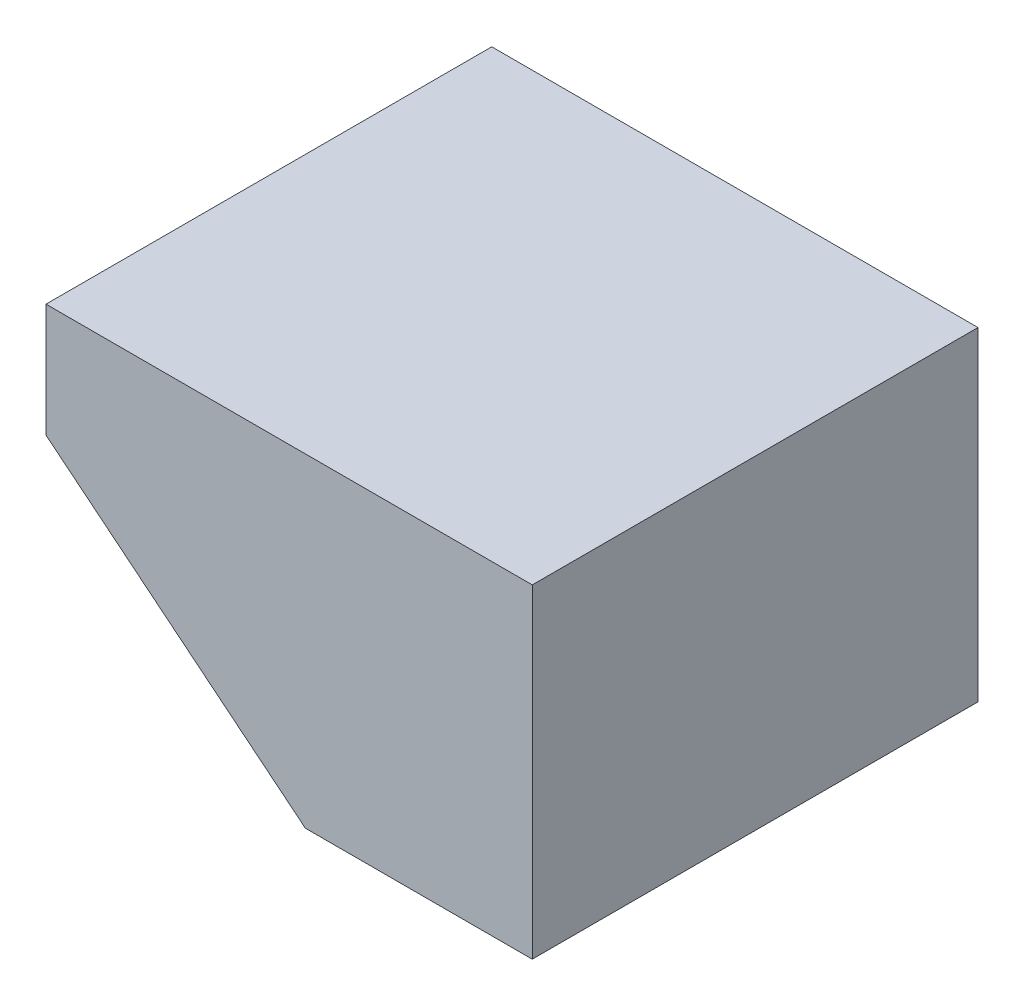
ISO-10303-21;
HEADER;
FILE_DESCRIPTION(('STEP AP214'),'2;1');
FILE_NAME('part.step','',(''),(''),'','','');
FILE_SCHEMA(('AUTOMOTIVE_DESIGN { 1 0 10303 214 1 1 1 1 }'));
ENDSEC;
DATA;
#1=APPLICATION_CONTEXT('core data for automotive mechanical design processes');
#2=APPLICATION_PROTOCOL_DEFINITION('international standard','automotive_design',2000,#1);
#3=PRODUCT_CONTEXT('',#1,'mechanical');
#4=PRODUCT('Part','Part','',(#3));
#5=PRODUCT_RELATED_PRODUCT_CATEGORY('part','',(#4));
#6=PRODUCT_DEFINITION_FORMATION('','',#4);
#7=PRODUCT_DEFINITION_CONTEXT('part definition',#1,'design');
#8=PRODUCT_DEFINITION('design','',#6,#7);
#9=PRODUCT_DEFINITION_SHAPE('','',#8);
#10=(LENGTH_UNIT() NAMED_UNIT(*) SI_UNIT(.MILLI.,.METRE.));
#11=(NAMED_UNIT(*) PLANE_ANGLE_UNIT() SI_UNIT($,.RADIAN.));
#12=(NAMED_UNIT(*) SI_UNIT($,.STERADIAN.) SOLID_ANGLE_UNIT());
#13=UNCERTAINTY_MEASURE_WITH_UNIT(LENGTH_MEASURE(1.E-05),#10,'distance_accuracy_value','');
#14=(GEOMETRIC_REPRESENTATION_CONTEXT(3) GLOBAL_UNCERTAINTY_ASSIGNED_CONTEXT((#13)) GLOBAL_UNIT_ASSIGNED_CONTEXT((#10,
#11,#12)) REPRESENTATION_CONTEXT('',''));
#15=CARTESIAN_POINT('',(0.,0.,0.));
#16=DIRECTION('',(0.,0.,1.));
#17=DIRECTION('',(1.,0.,0.));
#18=AXIS2_PLACEMENT_3D('',#15,#16,#17);
#19=CARTESIAN_POINT('',(0.,0.,55.));
#20=DIRECTION('',(-1.,0.,0.));
#21=DIRECTION('',(0.,0.,1.));
#22=AXIS2_PLACEMENT_3D('',#19,#20,#21);
#23=PLANE('',#22);
#24=DIRECTION('',(0.,1.,0.));
#25=VECTOR('',#24,1.);
#26=CARTESIAN_POINT('',(0.,0.,0.));
#27=LINE('',#26,#25);
#28=CARTESIAN_POINT('',(0.,0.,0.));
#29=VERTEX_POINT('',#28);
#30=CARTESIAN_POINT('',(0.,40.,0.));
#31=VERTEX_POINT('',#30);
#32=EDGE_CURVE('E118',#29,#31,#27,.T.);
#33=ORIENTED_EDGE('',*,*,#32,.T.);
#34=DIRECTION('',(0.,0.,-1.));
#35=VECTOR('',#34,1.);
#36=CARTESIAN_POINT('',(0.,40.,55.));
#37=LINE('',#36,#35);
#38=CARTESIAN_POINT('',(0.,40.,55.));
#39=VERTEX_POINT('',#38);
#40=EDGE_CURVE('E11',#39,#31,#37,.T.);
#41=ORIENTED_EDGE('',*,*,#40,.F.);
#42=DIRECTION('',(0.,1.,0.));
#43=VECTOR('',#42,1.);
#44=CARTESIAN_POINT('',(0.,0.,55.));
#45=LINE('',#44,#43);
#46=CARTESIAN_POINT('',(0.,0.,55.));
#47=VERTEX_POINT('',#46);
#48=EDGE_CURVE('E114',#47,#39,#45,.T.);
#49=ORIENTED_EDGE('',*,*,#48,.F.);
#50=DIRECTION('',(0.,0.,-1.));
#51=VECTOR('',#50,1.);
#52=CARTESIAN_POINT('',(0.,0.,55.));
#53=LINE('',#52,#51);
#54=EDGE_CURVE('E109',#47,#29,#53,.T.);
#55=ORIENTED_EDGE('',*,*,#54,.T.);
#56=EDGE_LOOP('',(#33,#41,#49,#55));
#57=FACE_BOUND('',#56,.T.);
#58=ADVANCED_FACE('F30',(#57),#23,.F.);
#59=CARTESIAN_POINT('',(0.,40.,55.));
#60=DIRECTION('',(0.,-1.,0.));
#61=DIRECTION('',(1.,0.,0.));
#62=AXIS2_PLACEMENT_3D('',#59,#60,#61);
#63=PLANE('',#62);
#64=DIRECTION('',(-1.,0.,0.));
#65=VECTOR('',#64,1.);
#66=CARTESIAN_POINT('',(0.,40.,0.));
#67=LINE('',#66,#65);
#68=CARTESIAN_POINT('',(-60.,40.,0.));
#69=VERTEX_POINT('',#68);
#70=EDGE_CURVE('E116',#31,#69,#67,.T.);
#71=ORIENTED_EDGE('',*,*,#70,.T.);
#72=DIRECTION('',(0.,0.,-1.));
#73=VECTOR('',#72,1.);
#74=CARTESIAN_POINT('',(-60.,40.,55.));
#75=LINE('',#74,#73);
#76=CARTESIAN_POINT('',(-60.,40.,55.));
#77=VERTEX_POINT('',#76);
#78=EDGE_CURVE('E37',#77,#69,#75,.T.);
#79=ORIENTED_EDGE('',*,*,#78,.F.);
#80=DIRECTION('',(-1.,0.,0.));
#81=VECTOR('',#80,1.);
#82=CARTESIAN_POINT('',(0.,40.,55.));
#83=LINE('',#82,#81);
#84=EDGE_CURVE('E77',#39,#77,#83,.T.);
#85=ORIENTED_EDGE('',*,*,#84,.F.);
#86=ORIENTED_EDGE('',*,*,#40,.T.);
#87=EDGE_LOOP('',(#71,#79,#85,#86));
#88=FACE_BOUND('',#87,.T.);
#89=ADVANCED_FACE('F136',(#88),#63,.F.);
#90=CARTESIAN_POINT('',(-60.,0.,55.));
#91=DIRECTION('',(1.,0.,0.));
#92=DIRECTION('',(0.,0.,-1.));
#93=AXIS2_PLACEMENT_3D('',#90,#91,#92);
#94=PLANE('',#93);
#95=DIRECTION('',(0.,-1.,0.));
#96=VECTOR('',#95,1.);
#97=CARTESIAN_POINT('',(-60.,0.,30.));
#98=LINE('',#97,#96);
#99=CARTESIAN_POINT('',(-60.,26.,30.));
#100=VERTEX_POINT('',#99);
#101=CARTESIAN_POINT('',(-60.,0.,30.));
#102=VERTEX_POINT('',#101);
#103=EDGE_CURVE('E91',#100,#102,#98,.T.);
#104=ORIENTED_EDGE('',*,*,#103,.F.);
#105=DIRECTION('',(0.,0.,1.));
#106=VECTOR('',#105,1.);
#107=CARTESIAN_POINT('',(-60.,26.,30.));
#108=LINE('',#107,#106);
#109=CARTESIAN_POINT('',(-60.,26.,55.));
#110=VERTEX_POINT('',#109);
#111=EDGE_CURVE('E121',#100,#110,#108,.T.);
#112=ORIENTED_EDGE('',*,*,#111,.T.);
#113=DIRECTION('',(0.,-1.,0.));
#114=VECTOR('',#113,1.);
#115=CARTESIAN_POINT('',(-60.,0.,55.));
#116=LINE('',#115,#114);
#117=EDGE_CURVE('E123',#77,#110,#116,.T.);
#118=ORIENTED_EDGE('',*,*,#117,.F.);
#119=ORIENTED_EDGE('',*,*,#78,.T.);
#120=DIRECTION('',(0.,-1.,0.));
#121=VECTOR('',#120,1.);
#122=CARTESIAN_POINT('',(-60.,0.,0.));
#123=LINE('',#122,#121);
#124=CARTESIAN_POINT('',(-60.,0.,0.));
#125=VERTEX_POINT('',#124);
#126=EDGE_CURVE('E108',#69,#125,#123,.T.);
#127=ORIENTED_EDGE('',*,*,#126,.T.);
#128=DIRECTION('',(0.,0.,-1.));
#129=VECTOR('',#128,1.);
#130=CARTESIAN_POINT('',(-60.,0.,55.));
#131=LINE('',#130,#129);
#132=EDGE_CURVE('E102',#102,#125,#131,.T.);
#133=ORIENTED_EDGE('',*,*,#132,.F.);
#134=EDGE_LOOP('',(#104,#112,#118,#119,#127,#133));
#135=FACE_BOUND('',#134,.T.);
#136=ADVANCED_FACE('F105',(#135),#94,.F.);
#137=CARTESIAN_POINT('',(0.,0.,55.));
#138=DIRECTION('',(0.,1.,0.));
#139=DIRECTION('',(-1.,0.,0.));
#140=AXIS2_PLACEMENT_3D('',#137,#138,#139);
#141=PLANE('',#140);
#142=DIRECTION('',(1.,0.,0.));
#143=VECTOR('',#142,1.);
#144=CARTESIAN_POINT('',(0.,0.,55.));
#145=LINE('',#144,#143);
#146=CARTESIAN_POINT('',(-28.,0.,55.));
#147=VERTEX_POINT('',#146);
#148=EDGE_CURVE('E52',#147,#47,#145,.T.);
#149=ORIENTED_EDGE('',*,*,#148,.F.);
#150=DIRECTION('',(0.,0.,1.));
#151=VECTOR('',#150,1.);
#152=CARTESIAN_POINT('',(-28.,0.,30.));
#153=LINE('',#152,#151);
#154=CARTESIAN_POINT('',(-28.,0.,30.));
#155=VERTEX_POINT('',#154);
#156=EDGE_CURVE('E44',#155,#147,#153,.T.);
#157=ORIENTED_EDGE('',*,*,#156,.F.);
#158=DIRECTION('',(1.,0.,0.));
#159=VECTOR('',#158,1.);
#160=CARTESIAN_POINT('',(-60.,0.,30.));
#161=LINE('',#160,#159);
#162=EDGE_CURVE('E94',#102,#155,#161,.T.);
#163=ORIENTED_EDGE('',*,*,#162,.F.);
#164=ORIENTED_EDGE('',*,*,#132,.T.);
#165=DIRECTION('',(1.,0.,0.));
#166=VECTOR('',#165,1.);
#167=CARTESIAN_POINT('',(0.,0.,0.));
#168=LINE('',#167,#166);
#169=EDGE_CURVE('E72',#125,#29,#168,.T.);
#170=ORIENTED_EDGE('',*,*,#169,.T.);
#171=ORIENTED_EDGE('',*,*,#54,.F.);
#172=EDGE_LOOP('',(#149,#157,#163,#164,#170,#171));
#173=FACE_BOUND('',#172,.T.);
#174=ADVANCED_FACE('F101',(#173),#141,.F.);
#175=CARTESIAN_POINT('',(0.,40.,55.));
#176=DIRECTION('',(0.,0.,1.));
#177=DIRECTION('',(1.,0.,0.));
#178=AXIS2_PLACEMENT_3D('',#175,#176,#177);
#179=PLANE('',#178);
#180=DIRECTION('',(-0.776114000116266,0.630592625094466,0.));
#181=VECTOR('',#180,1.);
#182=CARTESIAN_POINT('',(-60.,26.,55.));
#183=LINE('',#182,#181);
#184=EDGE_CURVE('E99',#147,#110,#183,.T.);
#185=ORIENTED_EDGE('',*,*,#184,.F.);
#186=ORIENTED_EDGE('',*,*,#148,.T.);
#187=ORIENTED_EDGE('',*,*,#48,.T.);
#188=ORIENTED_EDGE('',*,*,#84,.T.);
#189=ORIENTED_EDGE('',*,*,#117,.T.);
#190=EDGE_LOOP('',(#185,#186,#187,#188,#189));
#191=FACE_BOUND('',#190,.T.);
#192=ADVANCED_FACE('F133',(#191),#179,.T.);
#193=CARTESIAN_POINT('',(0.,40.,0.));
#194=DIRECTION('',(0.,0.,1.));
#195=DIRECTION('',(1.,0.,0.));
#196=AXIS2_PLACEMENT_3D('',#193,#194,#195);
#197=PLANE('',#196);
#198=ORIENTED_EDGE('',*,*,#32,.F.);
#199=ORIENTED_EDGE('',*,*,#169,.F.);
#200=ORIENTED_EDGE('',*,*,#126,.F.);
#201=ORIENTED_EDGE('',*,*,#70,.F.);
#202=EDGE_LOOP('',(#198,#199,#200,#201));
#203=FACE_BOUND('',#202,.T.);
#204=ADVANCED_FACE('F139',(#203),#197,.F.);
#205=CARTESIAN_POINT('',(-60.,26.,30.));
#206=DIRECTION('',(0.630592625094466,0.776114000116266,0.));
#207=DIRECTION('',(-0.776114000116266,0.630592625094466,0.));
#208=AXIS2_PLACEMENT_3D('',#205,#206,#207);
#209=PLANE('',#208);
#210=ORIENTED_EDGE('',*,*,#184,.T.);
#211=ORIENTED_EDGE('',*,*,#111,.F.);
#212=DIRECTION('',(-0.776114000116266,0.630592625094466,0.));
#213=VECTOR('',#212,1.);
#214=CARTESIAN_POINT('',(-60.,26.,30.));
#215=LINE('',#214,#213);
#216=EDGE_CURVE('E95',#155,#100,#215,.T.);
#217=ORIENTED_EDGE('',*,*,#216,.F.);
#218=ORIENTED_EDGE('',*,*,#156,.T.);
#219=EDGE_LOOP('',(#210,#211,#217,#218));
#220=FACE_BOUND('',#219,.T.);
#221=ADVANCED_FACE('F131',(#220),#209,.F.);
#222=CARTESIAN_POINT('',(-60.,0.,30.));
#223=DIRECTION('',(0.,0.,-1.));
#224=DIRECTION('',(-1.,0.,0.));
#225=AXIS2_PLACEMENT_3D('',#222,#223,#224);
#226=PLANE('',#225);
#227=ORIENTED_EDGE('',*,*,#103,.T.);
#228=ORIENTED_EDGE('',*,*,#162,.T.);
#229=ORIENTED_EDGE('',*,*,#216,.T.);
#230=EDGE_LOOP('',(#227,#228,#229));
#231=FACE_BOUND('',#230,.T.);
#232=ADVANCED_FACE('F93',(#231),#226,.F.);
#233=CLOSED_SHELL('',(#58,#89,#136,#174,#192,#204,#221,#232));
#234=MANIFOLD_SOLID_BREP('B2',#233);
#235=ADVANCED_BREP_SHAPE_REPRESENTATION('',(#18,#234),#14);
#236=SHAPE_DEFINITION_REPRESENTATION(#9,#235);
ENDSEC;
END-ISO-10303-21;
